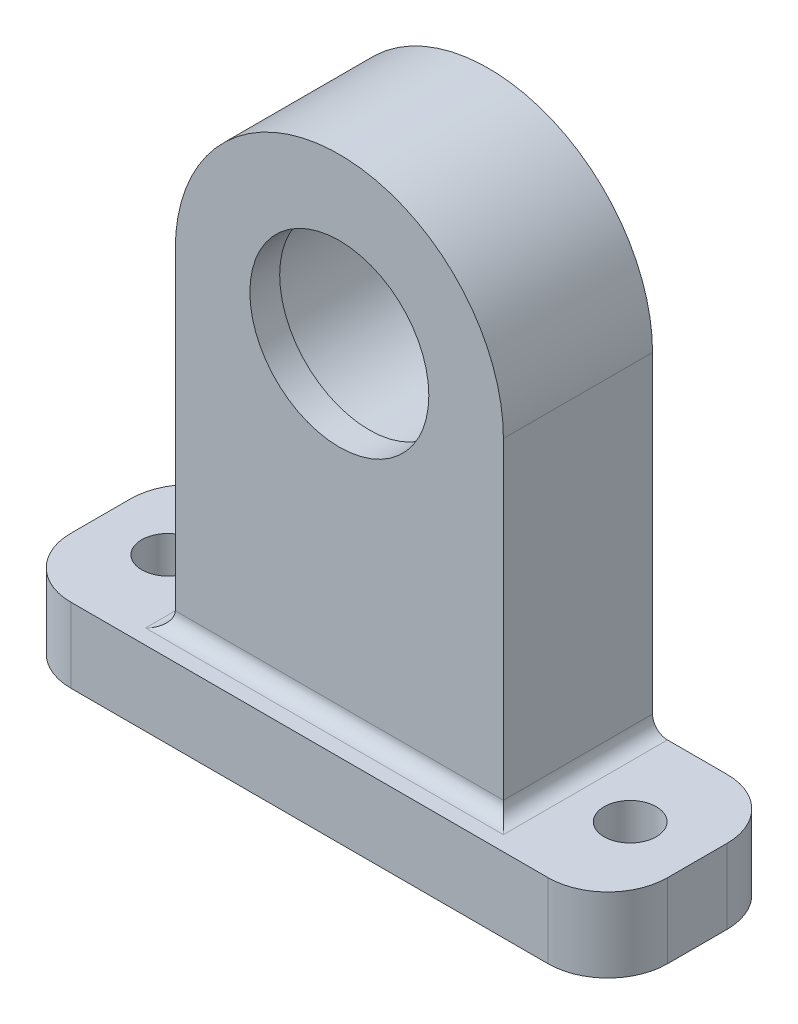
ISO-10303-21;
HEADER;
FILE_DESCRIPTION(('STEP AP214'),'2;1');
FILE_NAME('part.step','',(''),(''),'','','');
FILE_SCHEMA(('AUTOMOTIVE_DESIGN { 1 0 10303 214 1 1 1 1 }'));
ENDSEC;
DATA;
#1=APPLICATION_CONTEXT('core data for automotive mechanical design processes');
#2=APPLICATION_PROTOCOL_DEFINITION('international standard','automotive_design',2000,#1);
#3=PRODUCT_CONTEXT('',#1,'mechanical');
#4=PRODUCT('Part','Part','',(#3));
#5=PRODUCT_RELATED_PRODUCT_CATEGORY('part','',(#4));
#6=PRODUCT_DEFINITION_FORMATION('','',#4);
#7=PRODUCT_DEFINITION_CONTEXT('part definition',#1,'design');
#8=PRODUCT_DEFINITION('design','',#6,#7);
#9=PRODUCT_DEFINITION_SHAPE('','',#8);
#10=(LENGTH_UNIT() NAMED_UNIT(*) SI_UNIT(.MILLI.,.METRE.));
#11=(NAMED_UNIT(*) PLANE_ANGLE_UNIT() SI_UNIT($,.RADIAN.));
#12=(NAMED_UNIT(*) SI_UNIT($,.STERADIAN.) SOLID_ANGLE_UNIT());
#13=UNCERTAINTY_MEASURE_WITH_UNIT(LENGTH_MEASURE(1.E-05),#10,'distance_accuracy_value','');
#14=(GEOMETRIC_REPRESENTATION_CONTEXT(3) GLOBAL_UNCERTAINTY_ASSIGNED_CONTEXT((#13)) GLOBAL_UNIT_ASSIGNED_CONTEXT((#10,
#11,#12)) REPRESENTATION_CONTEXT('',''));
#15=CARTESIAN_POINT('',(0.,0.,0.));
#16=DIRECTION('',(0.,0.,1.));
#17=DIRECTION('',(1.,0.,0.));
#18=AXIS2_PLACEMENT_3D('',#15,#16,#17);
#19=CARTESIAN_POINT('',(11.,0.,10.));
#20=DIRECTION('',(1.,0.,0.));
#21=DIRECTION('',(0.,0.,-1.));
#22=AXIS2_PLACEMENT_3D('',#19,#20,#21);
#23=PLANE('',#22);
#24=DIRECTION('',(0.,-1.,0.));
#25=VECTOR('',#24,1.);
#26=CARTESIAN_POINT('',(11.,0.,10.));
#27=LINE('',#26,#25);
#28=CARTESIAN_POINT('',(11.,0.,10.));
#29=VERTEX_POINT('',#28);
#30=CARTESIAN_POINT('',(11.,-21.,10.));
#31=VERTEX_POINT('',#30);
#32=EDGE_CURVE('E162',#29,#31,#27,.T.);
#33=ORIENTED_EDGE('',*,*,#32,.T.);
#34=DIRECTION('',(0.,0.,-1.));
#35=VECTOR('',#34,1.);
#36=CARTESIAN_POINT('',(11.,-21.,0.));
#37=LINE('',#36,#35);
#38=CARTESIAN_POINT('',(11.,-21.,0.));
#39=VERTEX_POINT('',#38);
#40=EDGE_CURVE('E200',#31,#39,#37,.T.);
#41=ORIENTED_EDGE('',*,*,#40,.T.);
#42=DIRECTION('',(0.,-1.,0.));
#43=VECTOR('',#42,1.);
#44=CARTESIAN_POINT('',(11.,0.,0.));
#45=LINE('',#44,#43);
#46=CARTESIAN_POINT('',(11.,0.,0.));
#47=VERTEX_POINT('',#46);
#48=EDGE_CURVE('E182',#47,#39,#45,.T.);
#49=ORIENTED_EDGE('',*,*,#48,.F.);
#50=DIRECTION('',(0.,0.,-1.));
#51=VECTOR('',#50,1.);
#52=CARTESIAN_POINT('',(11.,0.,10.));
#53=LINE('',#52,#51);
#54=EDGE_CURVE('E173',#29,#47,#53,.T.);
#55=ORIENTED_EDGE('',*,*,#54,.F.);
#56=EDGE_LOOP('',(#33,#41,#49,#55));
#57=FACE_BOUND('',#56,.T.);
#58=ADVANCED_FACE('F50',(#57),#23,.T.);
#59=CARTESIAN_POINT('',(0.,0.,10.));
#60=DIRECTION('',(0.,0.,-1.));
#61=DIRECTION('',(-1.,0.,0.));
#62=AXIS2_PLACEMENT_3D('',#59,#60,#61);
#63=CYLINDRICAL_SURFACE('',#62,11.);
#64=CARTESIAN_POINT('',(0.,0.,0.));
#65=DIRECTION('',(0.,0.,1.));
#66=DIRECTION('',(1.,0.,0.));
#67=AXIS2_PLACEMENT_3D('',#64,#65,#66);
#68=CIRCLE('',#67,11.);
#69=CARTESIAN_POINT('',(-11.,0.,0.));
#70=VERTEX_POINT('',#69);
#71=EDGE_CURVE('E169',#47,#70,#68,.T.);
#72=ORIENTED_EDGE('',*,*,#71,.T.);
#73=DIRECTION('',(0.,0.,-1.));
#74=VECTOR('',#73,1.);
#75=CARTESIAN_POINT('',(-11.,0.,10.));
#76=LINE('',#75,#74);
#77=CARTESIAN_POINT('',(-11.,0.,10.));
#78=VERTEX_POINT('',#77);
#79=EDGE_CURVE('E164',#78,#70,#76,.T.);
#80=ORIENTED_EDGE('',*,*,#79,.F.);
#81=CARTESIAN_POINT('',(0.,0.,10.));
#82=DIRECTION('',(0.,0.,1.));
#83=DIRECTION('',(1.,0.,0.));
#84=AXIS2_PLACEMENT_3D('',#81,#82,#83);
#85=CIRCLE('',#84,11.);
#86=EDGE_CURVE('E155',#29,#78,#85,.T.);
#87=ORIENTED_EDGE('',*,*,#86,.F.);
#88=ORIENTED_EDGE('',*,*,#54,.T.);
#89=EDGE_LOOP('',(#72,#80,#87,#88));
#90=FACE_BOUND('',#89,.T.);
#91=ADVANCED_FACE('F167',(#90),#63,.T.);
#92=CARTESIAN_POINT('',(-11.,0.,10.));
#93=DIRECTION('',(1.,0.,0.));
#94=DIRECTION('',(0.,0.,-1.));
#95=AXIS2_PLACEMENT_3D('',#92,#93,#94);
#96=PLANE('',#95);
#97=DIRECTION('',(0.,-1.,0.));
#98=VECTOR('',#97,1.);
#99=CARTESIAN_POINT('',(-11.,0.,0.));
#100=LINE('',#99,#98);
#101=CARTESIAN_POINT('',(-11.,-21.,0.));
#102=VERTEX_POINT('',#101);
#103=EDGE_CURVE('E185',#70,#102,#100,.T.);
#104=ORIENTED_EDGE('',*,*,#103,.T.);
#105=DIRECTION('',(0.,0.,-1.));
#106=VECTOR('',#105,1.);
#107=CARTESIAN_POINT('',(-11.,-21.,10.));
#108=LINE('',#107,#106);
#109=CARTESIAN_POINT('',(-11.,-21.,10.));
#110=VERTEX_POINT('',#109);
#111=EDGE_CURVE('E177',#102,#110,#108,.F.);
#112=ORIENTED_EDGE('',*,*,#111,.T.);
#113=DIRECTION('',(0.,-1.,0.));
#114=VECTOR('',#113,1.);
#115=CARTESIAN_POINT('',(-11.,0.,10.));
#116=LINE('',#115,#114);
#117=EDGE_CURVE('E159',#78,#110,#116,.T.);
#118=ORIENTED_EDGE('',*,*,#117,.F.);
#119=ORIENTED_EDGE('',*,*,#79,.T.);
#120=EDGE_LOOP('',(#104,#112,#118,#119));
#121=FACE_BOUND('',#120,.T.);
#122=ADVANCED_FACE('F175',(#121),#96,.F.);
#123=CARTESIAN_POINT('',(0.,0.,10.));
#124=DIRECTION('',(0.,0.,1.));
#125=DIRECTION('',(1.,0.,0.));
#126=AXIS2_PLACEMENT_3D('',#123,#124,#125);
#127=PLANE('',#126);
#128=CARTESIAN_POINT('',(0.,0.,10.));
#129=DIRECTION('',(0.,0.,1.));
#130=DIRECTION('',(1.,0.,0.));
#131=AXIS2_PLACEMENT_3D('',#128,#129,#130);
#132=CIRCLE('',#131,6.);
#133=CARTESIAN_POINT('',(6.,0.,10.));
#134=VERTEX_POINT('',#133);
#135=EDGE_CURVE('E347',#134,#134,#132,.T.);
#136=ORIENTED_EDGE('',*,*,#135,.F.);
#137=EDGE_LOOP('',(#136));
#138=FACE_BOUND('',#137,.T.);
#139=ORIENTED_EDGE('',*,*,#117,.T.);
#140=DIRECTION('',(1.,0.,0.));
#141=VECTOR('',#140,1.);
#142=CARTESIAN_POINT('',(11.,-21.,10.));
#143=LINE('',#142,#141);
#144=EDGE_CURVE('E198',#110,#31,#143,.T.);
#145=ORIENTED_EDGE('',*,*,#144,.T.);
#146=ORIENTED_EDGE('',*,*,#32,.F.);
#147=ORIENTED_EDGE('',*,*,#86,.T.);
#148=EDGE_LOOP('',(#139,#145,#146,#147));
#149=FACE_BOUND('',#148,.T.);
#150=ADVANCED_FACE('F157',(#138,#149),#127,.T.);
#151=CARTESIAN_POINT('',(0.,0.,0.));
#152=DIRECTION('',(0.,0.,1.));
#153=DIRECTION('',(1.,0.,0.));
#154=AXIS2_PLACEMENT_3D('',#151,#152,#153);
#155=PLANE('',#154);
#156=CARTESIAN_POINT('',(0.,0.,0.));
#157=DIRECTION('',(0.,0.,1.));
#158=DIRECTION('',(1.,0.,0.));
#159=AXIS2_PLACEMENT_3D('',#156,#157,#158);
#160=CIRCLE('',#159,6.5);
#161=CARTESIAN_POINT('',(6.5,0.,0.));
#162=VERTEX_POINT('',#161);
#163=EDGE_CURVE('E213',#162,#162,#160,.T.);
#164=ORIENTED_EDGE('',*,*,#163,.T.);
#165=EDGE_LOOP('',(#164));
#166=FACE_BOUND('',#165,.T.);
#167=DIRECTION('',(1.,0.,0.));
#168=VECTOR('',#167,1.);
#169=CARTESIAN_POINT('',(-20.,-27.,0.));
#170=LINE('',#169,#168);
#171=CARTESIAN_POINT('',(-16.,-27.,0.));
#172=VERTEX_POINT('',#171);
#173=CARTESIAN_POINT('',(16.,-27.,0.));
#174=VERTEX_POINT('',#173);
#175=EDGE_CURVE('E186',#172,#174,#170,.T.);
#176=ORIENTED_EDGE('',*,*,#175,.F.);
#177=DIRECTION('',(0.,1.,0.));
#178=VECTOR('',#177,1.);
#179=CARTESIAN_POINT('',(-16.,0.,0.));
#180=LINE('',#179,#178);
#181=CARTESIAN_POINT('',(-16.,-22.,0.));
#182=VERTEX_POINT('',#181);
#183=EDGE_CURVE('E215',#172,#182,#180,.T.);
#184=ORIENTED_EDGE('',*,*,#183,.T.);
#185=DIRECTION('',(1.,0.,0.));
#186=VECTOR('',#185,1.);
#187=CARTESIAN_POINT('',(-20.,-22.,0.));
#188=LINE('',#187,#186);
#189=CARTESIAN_POINT('',(-12.,-22.,0.));
#190=VERTEX_POINT('',#189);
#191=EDGE_CURVE('E258',#182,#190,#188,.T.);
#192=ORIENTED_EDGE('',*,*,#191,.T.);
#193=CARTESIAN_POINT('',(-12.,-21.,0.));
#194=DIRECTION('',(0.,0.,1.));
#195=DIRECTION('',(1.,0.,0.));
#196=AXIS2_PLACEMENT_3D('',#193,#194,#195);
#197=CIRCLE('',#196,1.);
#198=EDGE_CURVE('E202',#190,#102,#197,.T.);
#199=ORIENTED_EDGE('',*,*,#198,.T.);
#200=ORIENTED_EDGE('',*,*,#103,.F.);
#201=ORIENTED_EDGE('',*,*,#71,.F.);
#202=ORIENTED_EDGE('',*,*,#48,.T.);
#203=CARTESIAN_POINT('',(12.,-21.,0.));
#204=DIRECTION('',(0.,0.,1.));
#205=DIRECTION('',(1.,0.,0.));
#206=AXIS2_PLACEMENT_3D('',#203,#204,#205);
#207=CIRCLE('',#206,1.);
#208=CARTESIAN_POINT('',(12.,-22.,0.));
#209=VERTEX_POINT('',#208);
#210=EDGE_CURVE('E204',#39,#209,#207,.T.);
#211=ORIENTED_EDGE('',*,*,#210,.T.);
#212=CARTESIAN_POINT('',(16.,-22.,0.));
#213=VERTEX_POINT('',#212);
#214=EDGE_CURVE('E271',#209,#213,#188,.T.);
#215=ORIENTED_EDGE('',*,*,#214,.T.);
#216=DIRECTION('',(0.,1.,0.));
#217=VECTOR('',#216,1.);
#218=CARTESIAN_POINT('',(16.,0.,0.));
#219=LINE('',#218,#217);
#220=EDGE_CURVE('E206',#213,#174,#219,.F.);
#221=ORIENTED_EDGE('',*,*,#220,.T.);
#222=EDGE_LOOP('',(#176,#184,#192,#199,#200,#201,#202,#211,#215,#221));
#223=FACE_BOUND('',#222,.T.);
#224=ADVANCED_FACE('F282',(#166,#223),#155,.F.);
#225=CARTESIAN_POINT('',(0.,-22.,0.));
#226=DIRECTION('',(0.,1.,0.));
#227=DIRECTION('',(0.,0.,1.));
#228=AXIS2_PLACEMENT_3D('',#225,#226,#227);
#229=PLANE('',#228);
#230=CARTESIAN_POINT('',(-15.5,-22.,6.));
#231=DIRECTION('',(0.,-1.,0.));
#232=DIRECTION('',(0.,0.,1.));
#233=AXIS2_PLACEMENT_3D('',#230,#231,#232);
#234=CIRCLE('',#233,1.75);
#235=CARTESIAN_POINT('',(-15.5,-22.,7.75));
#236=VERTEX_POINT('',#235);
#237=EDGE_CURVE('E337',#236,#236,#234,.T.);
#238=ORIENTED_EDGE('',*,*,#237,.T.);
#239=EDGE_LOOP('',(#238));
#240=FACE_BOUND('',#239,.T.);
#241=CARTESIAN_POINT('',(15.5,-22.,6.));
#242=DIRECTION('',(0.,-1.,0.));
#243=DIRECTION('',(0.,0.,-1.));
#244=AXIS2_PLACEMENT_3D('',#241,#242,#243);
#245=CIRCLE('',#244,1.75);
#246=CARTESIAN_POINT('',(15.5,-22.,4.25000000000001));
#247=VERTEX_POINT('',#246);
#248=EDGE_CURVE('E331',#247,#247,#245,.T.);
#249=ORIENTED_EDGE('',*,*,#248,.T.);
#250=EDGE_LOOP('',(#249));
#251=FACE_BOUND('',#250,.T.);
#252=ORIENTED_EDGE('',*,*,#191,.F.);
#253=CARTESIAN_POINT('',(-16.,-22.,4.));
#254=DIRECTION('',(0.,1.,0.));
#255=DIRECTION('',(0.,0.,1.));
#256=AXIS2_PLACEMENT_3D('',#253,#254,#255);
#257=CIRCLE('',#256,4.);
#258=CARTESIAN_POINT('',(-20.,-22.,4.));
#259=VERTEX_POINT('',#258);
#260=EDGE_CURVE('E224',#182,#259,#257,.T.);
#261=ORIENTED_EDGE('',*,*,#260,.T.);
#262=DIRECTION('',(0.,0.,-1.));
#263=VECTOR('',#262,1.);
#264=CARTESIAN_POINT('',(-20.,-22.,0.));
#265=LINE('',#264,#263);
#266=CARTESIAN_POINT('',(-20.,-22.,8.));
#267=VERTEX_POINT('',#266);
#268=EDGE_CURVE('E268',#267,#259,#265,.T.);
#269=ORIENTED_EDGE('',*,*,#268,.F.);
#270=CARTESIAN_POINT('',(-16.,-22.,8.));
#271=DIRECTION('',(0.,1.,0.));
#272=DIRECTION('',(0.,0.,1.));
#273=AXIS2_PLACEMENT_3D('',#270,#271,#272);
#274=CIRCLE('',#273,4.);
#275=CARTESIAN_POINT('',(-16.,-22.,12.));
#276=VERTEX_POINT('',#275);
#277=EDGE_CURVE('E222',#267,#276,#274,.T.);
#278=ORIENTED_EDGE('',*,*,#277,.T.);
#279=DIRECTION('',(-1.,0.,0.));
#280=VECTOR('',#279,1.);
#281=CARTESIAN_POINT('',(-20.,-22.,12.));
#282=LINE('',#281,#280);
#283=CARTESIAN_POINT('',(16.,-22.,12.));
#284=VERTEX_POINT('',#283);
#285=EDGE_CURVE('E263',#284,#276,#282,.T.);
#286=ORIENTED_EDGE('',*,*,#285,.F.);
#287=CARTESIAN_POINT('',(16.,-22.,8.00000000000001));
#288=DIRECTION('',(0.,1.,0.));
#289=DIRECTION('',(0.,0.,1.));
#290=AXIS2_PLACEMENT_3D('',#287,#288,#289);
#291=CIRCLE('',#290,4.);
#292=CARTESIAN_POINT('',(20.,-22.,8.00000000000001));
#293=VERTEX_POINT('',#292);
#294=EDGE_CURVE('E218',#284,#293,#291,.T.);
#295=ORIENTED_EDGE('',*,*,#294,.T.);
#296=DIRECTION('',(0.,0.,1.));
#297=VECTOR('',#296,1.);
#298=CARTESIAN_POINT('',(20.,-22.,0.));
#299=LINE('',#298,#297);
#300=CARTESIAN_POINT('',(20.,-22.,4.));
#301=VERTEX_POINT('',#300);
#302=EDGE_CURVE('E250',#301,#293,#299,.T.);
#303=ORIENTED_EDGE('',*,*,#302,.F.);
#304=CARTESIAN_POINT('',(16.,-22.,4.));
#305=DIRECTION('',(0.,1.,0.));
#306=DIRECTION('',(0.,0.,1.));
#307=AXIS2_PLACEMENT_3D('',#304,#305,#306);
#308=CIRCLE('',#307,4.);
#309=EDGE_CURVE('E220',#301,#213,#308,.T.);
#310=ORIENTED_EDGE('',*,*,#309,.T.);
#311=ORIENTED_EDGE('',*,*,#214,.F.);
#312=DIRECTION('',(0.,0.,-1.));
#313=VECTOR('',#312,1.);
#314=CARTESIAN_POINT('',(12.,-22.,10.));
#315=LINE('',#314,#313);
#316=CARTESIAN_POINT('',(12.,-22.,11.));
#317=VERTEX_POINT('',#316);
#318=EDGE_CURVE('E189',#209,#317,#315,.F.);
#319=ORIENTED_EDGE('',*,*,#318,.T.);
#320=DIRECTION('',(1.,0.,0.));
#321=VECTOR('',#320,1.);
#322=CARTESIAN_POINT('',(-11.,-22.,11.));
#323=LINE('',#322,#321);
#324=CARTESIAN_POINT('',(-12.,-22.,11.));
#325=VERTEX_POINT('',#324);
#326=EDGE_CURVE('E192',#317,#325,#323,.F.);
#327=ORIENTED_EDGE('',*,*,#326,.T.);
#328=DIRECTION('',(0.,0.,-1.));
#329=VECTOR('',#328,1.);
#330=CARTESIAN_POINT('',(-12.,-22.,0.));
#331=LINE('',#330,#329);
#332=EDGE_CURVE('E194',#325,#190,#331,.T.);
#333=ORIENTED_EDGE('',*,*,#332,.T.);
#334=EDGE_LOOP('',(#252,#261,#269,#278,#286,#295,#303,#310,#311,#319,#327,#333));
#335=FACE_BOUND('',#334,.T.);
#336=ADVANCED_FACE('F266',(#240,#251,#335),#229,.T.);
#337=CARTESIAN_POINT('',(0.,-27.,0.));
#338=DIRECTION('',(0.,1.,0.));
#339=DIRECTION('',(0.,0.,1.));
#340=AXIS2_PLACEMENT_3D('',#337,#338,#339);
#341=PLANE('',#340);
#342=DIRECTION('',(0.,0.,-1.));
#343=VECTOR('',#342,1.);
#344=CARTESIAN_POINT('',(-20.,-27.,0.));
#345=LINE('',#344,#343);
#346=CARTESIAN_POINT('',(-20.,-27.,8.));
#347=VERTEX_POINT('',#346);
#348=CARTESIAN_POINT('',(-20.,-27.,4.));
#349=VERTEX_POINT('',#348);
#350=EDGE_CURVE('E327',#347,#349,#345,.T.);
#351=ORIENTED_EDGE('',*,*,#350,.T.);
#352=CARTESIAN_POINT('',(-16.,-27.,4.));
#353=DIRECTION('',(0.,1.,0.));
#354=DIRECTION('',(0.,0.,1.));
#355=AXIS2_PLACEMENT_3D('',#352,#353,#354);
#356=CIRCLE('',#355,4.);
#357=EDGE_CURVE('E236',#349,#172,#356,.F.);
#358=ORIENTED_EDGE('',*,*,#357,.T.);
#359=ORIENTED_EDGE('',*,*,#175,.T.);
#360=CARTESIAN_POINT('',(16.,-27.,4.));
#361=DIRECTION('',(0.,1.,0.));
#362=DIRECTION('',(0.,0.,1.));
#363=AXIS2_PLACEMENT_3D('',#360,#361,#362);
#364=CIRCLE('',#363,4.);
#365=CARTESIAN_POINT('',(20.,-27.,4.));
#366=VERTEX_POINT('',#365);
#367=EDGE_CURVE('E232',#174,#366,#364,.F.);
#368=ORIENTED_EDGE('',*,*,#367,.T.);
#369=DIRECTION('',(0.,0.,1.));
#370=VECTOR('',#369,1.);
#371=CARTESIAN_POINT('',(20.,-27.,0.));
#372=LINE('',#371,#370);
#373=CARTESIAN_POINT('',(20.,-27.,8.00000000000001));
#374=VERTEX_POINT('',#373);
#375=EDGE_CURVE('E247',#366,#374,#372,.T.);
#376=ORIENTED_EDGE('',*,*,#375,.T.);
#377=CARTESIAN_POINT('',(16.,-27.,8.00000000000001));
#378=DIRECTION('',(0.,1.,0.));
#379=DIRECTION('',(0.,0.,1.));
#380=AXIS2_PLACEMENT_3D('',#377,#378,#379);
#381=CIRCLE('',#380,4.);
#382=CARTESIAN_POINT('',(16.,-27.,12.));
#383=VERTEX_POINT('',#382);
#384=EDGE_CURVE('E73',#374,#383,#381,.F.);
#385=ORIENTED_EDGE('',*,*,#384,.T.);
#386=DIRECTION('',(-1.,0.,0.));
#387=VECTOR('',#386,1.);
#388=CARTESIAN_POINT('',(-20.,-27.,12.));
#389=LINE('',#388,#387);
#390=CARTESIAN_POINT('',(-16.,-27.,12.));
#391=VERTEX_POINT('',#390);
#392=EDGE_CURVE('E257',#383,#391,#389,.T.);
#393=ORIENTED_EDGE('',*,*,#392,.T.);
#394=CARTESIAN_POINT('',(-16.,-27.,8.));
#395=DIRECTION('',(0.,1.,0.));
#396=DIRECTION('',(0.,0.,1.));
#397=AXIS2_PLACEMENT_3D('',#394,#395,#396);
#398=CIRCLE('',#397,4.);
#399=EDGE_CURVE('E234',#391,#347,#398,.F.);
#400=ORIENTED_EDGE('',*,*,#399,.T.);
#401=EDGE_LOOP('',(#351,#358,#359,#368,#376,#385,#393,#400));
#402=FACE_BOUND('',#401,.T.);
#403=CARTESIAN_POINT('',(15.5,-27.,6.));
#404=DIRECTION('',(0.,-1.,0.));
#405=DIRECTION('',(0.,0.,-1.));
#406=AXIS2_PLACEMENT_3D('',#403,#404,#405);
#407=CIRCLE('',#406,1.75);
#408=CARTESIAN_POINT('',(15.5,-27.,4.25000000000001));
#409=VERTEX_POINT('',#408);
#410=EDGE_CURVE('E273',#409,#409,#407,.T.);
#411=ORIENTED_EDGE('',*,*,#410,.F.);
#412=EDGE_LOOP('',(#411));
#413=FACE_BOUND('',#412,.T.);
#414=CARTESIAN_POINT('',(-15.5,-27.,6.));
#415=DIRECTION('',(0.,-1.,0.));
#416=DIRECTION('',(0.,0.,1.));
#417=AXIS2_PLACEMENT_3D('',#414,#415,#416);
#418=CIRCLE('',#417,1.75);
#419=CARTESIAN_POINT('',(-15.5,-27.,7.75));
#420=VERTEX_POINT('',#419);
#421=EDGE_CURVE('E334',#420,#420,#418,.T.);
#422=ORIENTED_EDGE('',*,*,#421,.F.);
#423=EDGE_LOOP('',(#422));
#424=FACE_BOUND('',#423,.T.);
#425=ADVANCED_FACE('F253',(#402,#413,#424),#341,.F.);
#426=CARTESIAN_POINT('',(20.,-27.,0.));
#427=DIRECTION('',(-1.,0.,0.));
#428=DIRECTION('',(0.,0.,1.));
#429=AXIS2_PLACEMENT_3D('',#426,#427,#428);
#430=PLANE('',#429);
#431=ORIENTED_EDGE('',*,*,#375,.F.);
#432=DIRECTION('',(0.,1.,0.));
#433=VECTOR('',#432,1.);
#434=CARTESIAN_POINT('',(20.,-27.,4.));
#435=LINE('',#434,#433);
#436=EDGE_CURVE('E13',#366,#301,#435,.T.);
#437=ORIENTED_EDGE('',*,*,#436,.T.);
#438=ORIENTED_EDGE('',*,*,#302,.T.);
#439=DIRECTION('',(0.,1.,0.));
#440=VECTOR('',#439,1.);
#441=CARTESIAN_POINT('',(20.,-27.,8.00000000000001));
#442=LINE('',#441,#440);
#443=EDGE_CURVE('E59',#293,#374,#442,.F.);
#444=ORIENTED_EDGE('',*,*,#443,.T.);
#445=EDGE_LOOP('',(#431,#437,#438,#444));
#446=FACE_BOUND('',#445,.T.);
#447=ADVANCED_FACE('F246',(#446),#430,.F.);
#448=CARTESIAN_POINT('',(-20.,-27.,12.));
#449=DIRECTION('',(0.,0.,-1.));
#450=DIRECTION('',(-1.,0.,0.));
#451=AXIS2_PLACEMENT_3D('',#448,#449,#450);
#452=PLANE('',#451);
#453=ORIENTED_EDGE('',*,*,#285,.T.);
#454=DIRECTION('',(0.,1.,0.));
#455=VECTOR('',#454,1.);
#456=CARTESIAN_POINT('',(-16.,-27.,12.));
#457=LINE('',#456,#455);
#458=EDGE_CURVE('E66',#276,#391,#457,.F.);
#459=ORIENTED_EDGE('',*,*,#458,.T.);
#460=ORIENTED_EDGE('',*,*,#392,.F.);
#461=DIRECTION('',(0.,1.,0.));
#462=VECTOR('',#461,1.);
#463=CARTESIAN_POINT('',(16.,-27.,12.));
#464=LINE('',#463,#462);
#465=EDGE_CURVE('E238',#383,#284,#464,.T.);
#466=ORIENTED_EDGE('',*,*,#465,.T.);
#467=EDGE_LOOP('',(#453,#459,#460,#466));
#468=FACE_BOUND('',#467,.T.);
#469=ADVANCED_FACE('F262',(#468),#452,.F.);
#470=CARTESIAN_POINT('',(-20.,-27.,0.));
#471=DIRECTION('',(1.,0.,0.));
#472=DIRECTION('',(0.,0.,-1.));
#473=AXIS2_PLACEMENT_3D('',#470,#471,#472);
#474=PLANE('',#473);
#475=ORIENTED_EDGE('',*,*,#268,.T.);
#476=DIRECTION('',(0.,1.,0.));
#477=VECTOR('',#476,1.);
#478=CARTESIAN_POINT('',(-20.,-27.,4.));
#479=LINE('',#478,#477);
#480=EDGE_CURVE('E229',#259,#349,#479,.F.);
#481=ORIENTED_EDGE('',*,*,#480,.T.);
#482=ORIENTED_EDGE('',*,*,#350,.F.);
#483=DIRECTION('',(0.,1.,0.));
#484=VECTOR('',#483,1.);
#485=CARTESIAN_POINT('',(-20.,-27.,8.));
#486=LINE('',#485,#484);
#487=EDGE_CURVE('E226',#347,#267,#486,.T.);
#488=ORIENTED_EDGE('',*,*,#487,.T.);
#489=EDGE_LOOP('',(#475,#481,#482,#488));
#490=FACE_BOUND('',#489,.T.);
#491=ADVANCED_FACE('F374',(#490),#474,.F.);
#492=CARTESIAN_POINT('',(15.5,-27.,6.));
#493=DIRECTION('',(0.,1.,0.));
#494=DIRECTION('',(0.,0.,1.));
#495=AXIS2_PLACEMENT_3D('',#492,#493,#494);
#496=CYLINDRICAL_SURFACE('',#495,1.75);
#497=ORIENTED_EDGE('',*,*,#410,.T.);
#498=EDGE_LOOP('',(#497));
#499=FACE_BOUND('',#498,.T.);
#500=ORIENTED_EDGE('',*,*,#248,.F.);
#501=EDGE_LOOP('',(#500));
#502=FACE_BOUND('',#501,.T.);
#503=ADVANCED_FACE('F370',(#499,#502),#496,.F.);
#504=CARTESIAN_POINT('',(-15.5,-27.,6.));
#505=DIRECTION('',(0.,1.,0.));
#506=DIRECTION('',(0.,0.,1.));
#507=AXIS2_PLACEMENT_3D('',#504,#505,#506);
#508=CYLINDRICAL_SURFACE('',#507,1.75);
#509=ORIENTED_EDGE('',*,*,#421,.T.);
#510=EDGE_LOOP('',(#509));
#511=FACE_BOUND('',#510,.T.);
#512=ORIENTED_EDGE('',*,*,#237,.F.);
#513=EDGE_LOOP('',(#512));
#514=FACE_BOUND('',#513,.T.);
#515=ADVANCED_FACE('F366',(#511,#514),#508,.F.);
#516=CARTESIAN_POINT('',(0.,0.,8.));
#517=DIRECTION('',(0.,0.,-1.));
#518=DIRECTION('',(-1.,0.,0.));
#519=AXIS2_PLACEMENT_3D('',#516,#517,#518);
#520=CYLINDRICAL_SURFACE('',#519,6.5);
#521=CARTESIAN_POINT('',(0.,0.,8.));
#522=DIRECTION('',(0.,0.,1.));
#523=DIRECTION('',(1.,0.,0.));
#524=AXIS2_PLACEMENT_3D('',#521,#522,#523);
#525=CIRCLE('',#524,6.5);
#526=CARTESIAN_POINT('',(6.5,0.,8.));
#527=VERTEX_POINT('',#526);
#528=EDGE_CURVE('E340',#527,#527,#525,.T.);
#529=ORIENTED_EDGE('',*,*,#528,.T.);
#530=EDGE_LOOP('',(#529));
#531=FACE_BOUND('',#530,.T.);
#532=ORIENTED_EDGE('',*,*,#163,.F.);
#533=EDGE_LOOP('',(#532));
#534=FACE_BOUND('',#533,.T.);
#535=ADVANCED_FACE('F363',(#531,#534),#520,.F.);
#536=CARTESIAN_POINT('',(0.,0.,8.));
#537=DIRECTION('',(0.,0.,1.));
#538=DIRECTION('',(1.,0.,0.));
#539=AXIS2_PLACEMENT_3D('',#536,#537,#538);
#540=PLANE('',#539);
#541=CARTESIAN_POINT('',(0.,0.,8.));
#542=DIRECTION('',(0.,0.,1.));
#543=DIRECTION('',(1.,0.,0.));
#544=AXIS2_PLACEMENT_3D('',#541,#542,#543);
#545=CIRCLE('',#544,6.);
#546=CARTESIAN_POINT('',(6.,0.,8.));
#547=VERTEX_POINT('',#546);
#548=EDGE_CURVE('E54',#547,#547,#545,.T.);
#549=ORIENTED_EDGE('',*,*,#548,.T.);
#550=EDGE_LOOP('',(#549));
#551=FACE_BOUND('',#550,.T.);
#552=ORIENTED_EDGE('',*,*,#528,.F.);
#553=EDGE_LOOP('',(#552));
#554=FACE_BOUND('',#553,.T.);
#555=ADVANCED_FACE('F317',(#551,#554),#540,.F.);
#556=CARTESIAN_POINT('',(12.,-21.,10.));
#557=DIRECTION('',(0.,0.,1.));
#558=DIRECTION('',(1.,0.,0.));
#559=AXIS2_PLACEMENT_3D('',#556,#557,#558);
#560=CYLINDRICAL_SURFACE('',#559,1.);
#561=ORIENTED_EDGE('',*,*,#210,.F.);
#562=ORIENTED_EDGE('',*,*,#40,.F.);
#563=CARTESIAN_POINT('',(12.,-21.,11.));
#564=DIRECTION('',(-0.707106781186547,0.,0.707106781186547));
#565=DIRECTION('',(0.707106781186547,0.,0.707106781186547));
#566=AXIS2_PLACEMENT_3D('',#563,#564,#565);
#567=ELLIPSE('',#566,1.41421356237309,1.);
#568=EDGE_CURVE('E210',#317,#31,#567,.F.);
#569=ORIENTED_EDGE('',*,*,#568,.F.);
#570=ORIENTED_EDGE('',*,*,#318,.F.);
#571=EDGE_LOOP('',(#561,#562,#569,#570));
#572=FACE_BOUND('',#571,.T.);
#573=ADVANCED_FACE('F313',(#572),#560,.F.);
#574=CARTESIAN_POINT('',(0.,-21.,11.));
#575=DIRECTION('',(-1.,0.,0.));
#576=DIRECTION('',(0.,0.,1.));
#577=AXIS2_PLACEMENT_3D('',#574,#575,#576);
#578=CYLINDRICAL_SURFACE('',#577,1.);
#579=ORIENTED_EDGE('',*,*,#568,.T.);
#580=ORIENTED_EDGE('',*,*,#144,.F.);
#581=CARTESIAN_POINT('',(-12.,-21.,11.));
#582=DIRECTION('',(-0.707106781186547,0.,-0.707106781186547));
#583=DIRECTION('',(-0.707106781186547,0.,0.707106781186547));
#584=AXIS2_PLACEMENT_3D('',#581,#582,#583);
#585=ELLIPSE('',#584,1.41421356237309,1.);
#586=EDGE_CURVE('E207',#325,#110,#585,.F.);
#587=ORIENTED_EDGE('',*,*,#586,.F.);
#588=ORIENTED_EDGE('',*,*,#326,.F.);
#589=EDGE_LOOP('',(#579,#580,#587,#588));
#590=FACE_BOUND('',#589,.T.);
#591=ADVANCED_FACE('F309',(#590),#578,.F.);
#592=CARTESIAN_POINT('',(-12.,-21.,0.));
#593=DIRECTION('',(0.,0.,-1.));
#594=DIRECTION('',(-1.,0.,0.));
#595=AXIS2_PLACEMENT_3D('',#592,#593,#594);
#596=CYLINDRICAL_SURFACE('',#595,1.);
#597=ORIENTED_EDGE('',*,*,#586,.T.);
#598=ORIENTED_EDGE('',*,*,#111,.F.);
#599=ORIENTED_EDGE('',*,*,#198,.F.);
#600=ORIENTED_EDGE('',*,*,#332,.F.);
#601=EDGE_LOOP('',(#597,#598,#599,#600));
#602=FACE_BOUND('',#601,.T.);
#603=ADVANCED_FACE('F306',(#602),#596,.F.);
#604=CARTESIAN_POINT('',(-16.,0.,4.));
#605=DIRECTION('',(0.,1.,0.));
#606=DIRECTION('',(0.,0.,1.));
#607=AXIS2_PLACEMENT_3D('',#604,#605,#606);
#608=CYLINDRICAL_SURFACE('',#607,4.);
#609=ORIENTED_EDGE('',*,*,#357,.F.);
#610=ORIENTED_EDGE('',*,*,#480,.F.);
#611=ORIENTED_EDGE('',*,*,#260,.F.);
#612=ORIENTED_EDGE('',*,*,#183,.F.);
#613=EDGE_LOOP('',(#609,#610,#611,#612));
#614=FACE_BOUND('',#613,.T.);
#615=ADVANCED_FACE('F294',(#614),#608,.T.);
#616=CARTESIAN_POINT('',(-16.,-27.,8.));
#617=DIRECTION('',(0.,1.,0.));
#618=DIRECTION('',(0.,0.,1.));
#619=AXIS2_PLACEMENT_3D('',#616,#617,#618);
#620=CYLINDRICAL_SURFACE('',#619,4.);
#621=ORIENTED_EDGE('',*,*,#399,.F.);
#622=ORIENTED_EDGE('',*,*,#458,.F.);
#623=ORIENTED_EDGE('',*,*,#277,.F.);
#624=ORIENTED_EDGE('',*,*,#487,.F.);
#625=EDGE_LOOP('',(#621,#622,#623,#624));
#626=FACE_BOUND('',#625,.T.);
#627=ADVANCED_FACE('F288',(#626),#620,.T.);
#628=CARTESIAN_POINT('',(16.,-27.,4.));
#629=DIRECTION('',(0.,1.,0.));
#630=DIRECTION('',(0.,0.,1.));
#631=AXIS2_PLACEMENT_3D('',#628,#629,#630);
#632=CYLINDRICAL_SURFACE('',#631,4.);
#633=ORIENTED_EDGE('',*,*,#367,.F.);
#634=ORIENTED_EDGE('',*,*,#220,.F.);
#635=ORIENTED_EDGE('',*,*,#309,.F.);
#636=ORIENTED_EDGE('',*,*,#436,.F.);
#637=EDGE_LOOP('',(#633,#634,#635,#636));
#638=FACE_BOUND('',#637,.T.);
#639=ADVANCED_FACE('F286',(#638),#632,.T.);
#640=CARTESIAN_POINT('',(16.,-27.,8.00000000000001));
#641=DIRECTION('',(0.,1.,0.));
#642=DIRECTION('',(0.,0.,1.));
#643=AXIS2_PLACEMENT_3D('',#640,#641,#642);
#644=CYLINDRICAL_SURFACE('',#643,4.);
#645=ORIENTED_EDGE('',*,*,#384,.F.);
#646=ORIENTED_EDGE('',*,*,#443,.F.);
#647=ORIENTED_EDGE('',*,*,#294,.F.);
#648=ORIENTED_EDGE('',*,*,#465,.F.);
#649=EDGE_LOOP('',(#645,#646,#647,#648));
#650=FACE_BOUND('',#649,.T.);
#651=ADVANCED_FACE('F52',(#650),#644,.T.);
#652=CARTESIAN_POINT('',(0.,0.,0.));
#653=DIRECTION('',(0.,0.,1.));
#654=DIRECTION('',(1.,0.,0.));
#655=AXIS2_PLACEMENT_3D('',#652,#653,#654);
#656=CYLINDRICAL_SURFACE('',#655,6.);
#657=ORIENTED_EDGE('',*,*,#135,.T.);
#658=EDGE_LOOP('',(#657));
#659=FACE_BOUND('',#658,.T.);
#660=ORIENTED_EDGE('',*,*,#548,.F.);
#661=EDGE_LOOP('',(#660));
#662=FACE_BOUND('',#661,.T.);
#663=ADVANCED_FACE('F293',(#659,#662),#656,.F.);
#664=CLOSED_SHELL('',(#58,#91,#122,#150,#224,#336,#425,#447,#469,#491,#503,#515,#535,#555,#573,
#591,#603,#615,#627,#639,#651,#663));
#665=MANIFOLD_SOLID_BREP('B2',#664);
#666=ADVANCED_BREP_SHAPE_REPRESENTATION('',(#18,#665),#14);
#667=SHAPE_DEFINITION_REPRESENTATION(#9,#666);
ENDSEC;
END-ISO-10303-21;
